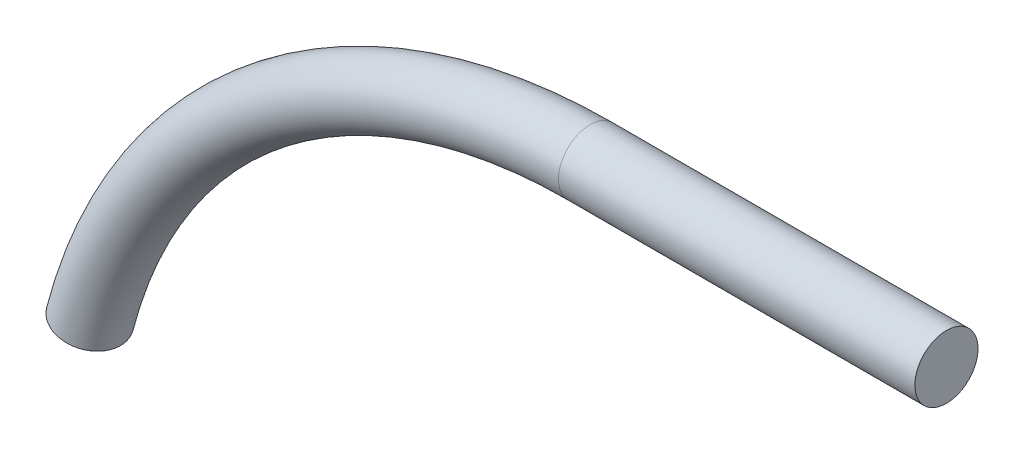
from build123d import *

# Parameters (mm, degrees)
SKIZZE3_R = 2.5


with BuildPart() as part:
    # Austragung1: sweep along a path in Skizze1
    with BuildLine(Plane.XY) as austragung1_path:
        Line((0, 0), (-28.207244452, 0))
        ThreePointArc((-28.207244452, 0), (-53.221184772, -8.540800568), (-67.788301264, -30.596221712))
    # Skizze3 → Austragung1 (sweep)
    with BuildSketch(Plane(origin=(0, 0, 0), x_dir=(0, 0, -1), z_dir=(1, 0, 0))):
        Circle(SKIZZE3_R)
    sweep(path=austragung1_path.line)


solid = part.part
